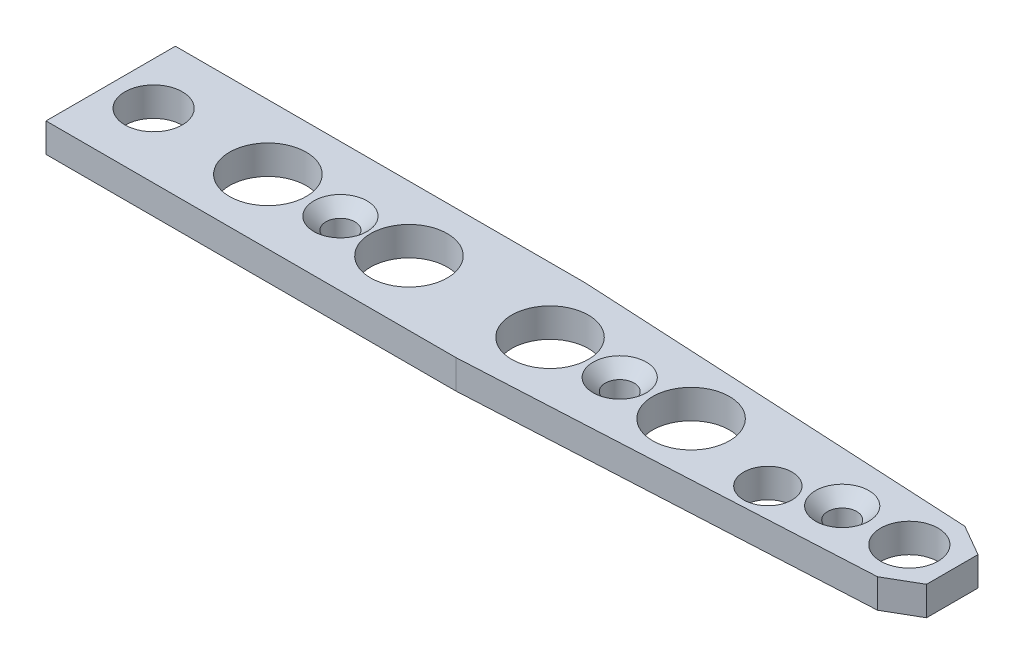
ISO-10303-21;
HEADER;
FILE_DESCRIPTION(('STEP AP214'),'2;1');
FILE_NAME('part.step','',(''),(''),'','','');
FILE_SCHEMA(('AUTOMOTIVE_DESIGN { 1 0 10303 214 1 1 1 1 }'));
ENDSEC;
DATA;
#1=APPLICATION_CONTEXT('core data for automotive mechanical design processes');
#2=APPLICATION_PROTOCOL_DEFINITION('international standard','automotive_design',2000,#1);
#3=PRODUCT_CONTEXT('',#1,'mechanical');
#4=PRODUCT('Part','Part','',(#3));
#5=PRODUCT_RELATED_PRODUCT_CATEGORY('part','',(#4));
#6=PRODUCT_DEFINITION_FORMATION('','',#4);
#7=PRODUCT_DEFINITION_CONTEXT('part definition',#1,'design');
#8=PRODUCT_DEFINITION('design','',#6,#7);
#9=PRODUCT_DEFINITION_SHAPE('','',#8);
#10=(LENGTH_UNIT() NAMED_UNIT(*) SI_UNIT(.MILLI.,.METRE.));
#11=(NAMED_UNIT(*) PLANE_ANGLE_UNIT() SI_UNIT($,.RADIAN.));
#12=(NAMED_UNIT(*) SI_UNIT($,.STERADIAN.) SOLID_ANGLE_UNIT());
#13=UNCERTAINTY_MEASURE_WITH_UNIT(LENGTH_MEASURE(1.E-05),#10,'distance_accuracy_value','');
#14=(GEOMETRIC_REPRESENTATION_CONTEXT(3) GLOBAL_UNCERTAINTY_ASSIGNED_CONTEXT((#13)) GLOBAL_UNIT_ASSIGNED_CONTEXT((#10,
#11,#12)) REPRESENTATION_CONTEXT('',''));
#15=CARTESIAN_POINT('',(0.,0.,0.));
#16=DIRECTION('',(0.,0.,1.));
#17=DIRECTION('',(1.,0.,0.));
#18=AXIS2_PLACEMENT_3D('',#15,#16,#17);
#19=CARTESIAN_POINT('',(69.6,-72.817682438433,3.47875163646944));
#20=DIRECTION('',(0.0523359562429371,0.,0.998629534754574));
#21=DIRECTION('',(0.998629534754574,0.,-0.0523359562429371));
#22=AXIS2_PLACEMENT_3D('',#19,#20,#21);
#23=PLANE('',#22);
#24=DIRECTION('',(-0.998629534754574,0.,0.0523359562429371));
#25=VECTOR('',#24,1.);
#26=CARTESIAN_POINT('',(69.6,-2.4,3.47875163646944));
#27=LINE('',#26,#25);
#28=CARTESIAN_POINT('',(67.0282897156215,-2.4,3.61352926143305));
#29=VERTEX_POINT('',#28);
#30=CARTESIAN_POINT('',(33.894454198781,-2.4,5.35));
#31=VERTEX_POINT('',#30);
#32=EDGE_CURVE('E152',#29,#31,#27,.T.);
#33=ORIENTED_EDGE('',*,*,#32,.F.);
#34=DIRECTION('',(0.,1.,0.));
#35=VECTOR('',#34,1.);
#36=CARTESIAN_POINT('',(67.0282897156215,-72.817682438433,3.61352926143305));
#37=LINE('',#36,#35);
#38=CARTESIAN_POINT('',(67.0282897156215,0.,3.61352926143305));
#39=VERTEX_POINT('',#38);
#40=EDGE_CURVE('E13',#29,#39,#37,.T.);
#41=ORIENTED_EDGE('',*,*,#40,.T.);
#42=DIRECTION('',(0.998629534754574,0.,-0.0523359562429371));
#43=VECTOR('',#42,1.);
#44=CARTESIAN_POINT('',(69.6,0.,3.47875163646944));
#45=LINE('',#44,#43);
#46=CARTESIAN_POINT('',(33.894454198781,0.,5.35));
#47=VERTEX_POINT('',#46);
#48=EDGE_CURVE('E317',#47,#39,#45,.T.);
#49=ORIENTED_EDGE('',*,*,#48,.F.);
#50=DIRECTION('',(0.,1.,0.));
#51=VECTOR('',#50,1.);
#52=CARTESIAN_POINT('',(33.894454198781,-72.817682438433,5.35));
#53=LINE('',#52,#51);
#54=EDGE_CURVE('E144',#31,#47,#53,.T.);
#55=ORIENTED_EDGE('',*,*,#54,.F.);
#56=EDGE_LOOP('',(#33,#41,#49,#55));
#57=FACE_BOUND('',#56,.T.);
#58=ADVANCED_FACE('F48',(#57),#23,.T.);
#59=CARTESIAN_POINT('',(33.894454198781,-72.817682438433,5.35));
#60=DIRECTION('',(0.,0.,1.));
#61=DIRECTION('',(1.,0.,0.));
#62=AXIS2_PLACEMENT_3D('',#59,#60,#61);
#63=PLANE('',#62);
#64=DIRECTION('',(-1.,0.,0.));
#65=VECTOR('',#64,1.);
#66=CARTESIAN_POINT('',(33.894454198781,-2.4,5.35));
#67=LINE('',#66,#65);
#68=CARTESIAN_POINT('',(0.,-2.4,5.35));
#69=VERTEX_POINT('',#68);
#70=EDGE_CURVE('E331',#31,#69,#67,.T.);
#71=ORIENTED_EDGE('',*,*,#70,.F.);
#72=ORIENTED_EDGE('',*,*,#54,.T.);
#73=DIRECTION('',(1.,0.,0.));
#74=VECTOR('',#73,1.);
#75=CARTESIAN_POINT('',(33.894454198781,0.,5.35));
#76=LINE('',#75,#74);
#77=CARTESIAN_POINT('',(0.,0.,5.35));
#78=VERTEX_POINT('',#77);
#79=EDGE_CURVE('E132',#78,#47,#76,.T.);
#80=ORIENTED_EDGE('',*,*,#79,.F.);
#81=DIRECTION('',(0.,1.,0.));
#82=VECTOR('',#81,1.);
#83=CARTESIAN_POINT('',(0.,-72.817682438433,5.35));
#84=LINE('',#83,#82);
#85=EDGE_CURVE('E146',#69,#78,#84,.T.);
#86=ORIENTED_EDGE('',*,*,#85,.F.);
#87=EDGE_LOOP('',(#71,#72,#80,#86));
#88=FACE_BOUND('',#87,.T.);
#89=ADVANCED_FACE('F183',(#88),#63,.T.);
#90=CARTESIAN_POINT('',(0.,-72.817682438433,-5.35));
#91=DIRECTION('',(-1.,0.,0.));
#92=DIRECTION('',(0.,0.,1.));
#93=AXIS2_PLACEMENT_3D('',#90,#91,#92);
#94=PLANE('',#93);
#95=DIRECTION('',(0.,0.,-1.));
#96=VECTOR('',#95,1.);
#97=CARTESIAN_POINT('',(0.,-2.4,-5.35));
#98=LINE('',#97,#96);
#99=CARTESIAN_POINT('',(0.,-2.4,-5.35));
#100=VERTEX_POINT('',#99);
#101=EDGE_CURVE('E329',#69,#100,#98,.T.);
#102=ORIENTED_EDGE('',*,*,#101,.F.);
#103=ORIENTED_EDGE('',*,*,#85,.T.);
#104=DIRECTION('',(0.,0.,1.));
#105=VECTOR('',#104,1.);
#106=CARTESIAN_POINT('',(0.,0.,-5.35));
#107=LINE('',#106,#105);
#108=CARTESIAN_POINT('',(0.,0.,-5.35));
#109=VERTEX_POINT('',#108);
#110=EDGE_CURVE('E137',#109,#78,#107,.T.);
#111=ORIENTED_EDGE('',*,*,#110,.F.);
#112=DIRECTION('',(0.,1.,0.));
#113=VECTOR('',#112,1.);
#114=CARTESIAN_POINT('',(0.,-72.817682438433,-5.35));
#115=LINE('',#114,#113);
#116=EDGE_CURVE('E131',#100,#109,#115,.T.);
#117=ORIENTED_EDGE('',*,*,#116,.F.);
#118=EDGE_LOOP('',(#102,#103,#111,#117));
#119=FACE_BOUND('',#118,.T.);
#120=ADVANCED_FACE('F188',(#119),#94,.T.);
#121=CARTESIAN_POINT('',(0.,-72.817682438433,-5.35));
#122=DIRECTION('',(0.,0.,-1.));
#123=DIRECTION('',(-1.,0.,0.));
#124=AXIS2_PLACEMENT_3D('',#121,#122,#123);
#125=PLANE('',#124);
#126=DIRECTION('',(1.,0.,0.));
#127=VECTOR('',#126,1.);
#128=CARTESIAN_POINT('',(0.,-2.4,-5.35));
#129=LINE('',#128,#127);
#130=CARTESIAN_POINT('',(33.894454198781,-2.4,-5.35));
#131=VERTEX_POINT('',#130);
#132=EDGE_CURVE('E327',#100,#131,#129,.T.);
#133=ORIENTED_EDGE('',*,*,#132,.F.);
#134=ORIENTED_EDGE('',*,*,#116,.T.);
#135=DIRECTION('',(-1.,0.,0.));
#136=VECTOR('',#135,1.);
#137=CARTESIAN_POINT('',(0.,0.,-5.35));
#138=LINE('',#137,#136);
#139=CARTESIAN_POINT('',(33.894454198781,0.,-5.35));
#140=VERTEX_POINT('',#139);
#141=EDGE_CURVE('E121',#140,#109,#138,.T.);
#142=ORIENTED_EDGE('',*,*,#141,.F.);
#143=DIRECTION('',(0.,1.,0.));
#144=VECTOR('',#143,1.);
#145=CARTESIAN_POINT('',(33.894454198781,-72.817682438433,-5.35));
#146=LINE('',#145,#144);
#147=EDGE_CURVE('E126',#131,#140,#146,.T.);
#148=ORIENTED_EDGE('',*,*,#147,.F.);
#149=EDGE_LOOP('',(#133,#134,#142,#148));
#150=FACE_BOUND('',#149,.T.);
#151=ADVANCED_FACE('F134',(#150),#125,.T.);
#152=CARTESIAN_POINT('',(33.894454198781,-72.817682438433,-5.35));
#153=DIRECTION('',(0.0523359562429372,0.,-0.998629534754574));
#154=DIRECTION('',(-0.998629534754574,0.,-0.0523359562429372));
#155=AXIS2_PLACEMENT_3D('',#152,#153,#154);
#156=PLANE('',#155);
#157=DIRECTION('',(-0.998629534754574,0.,-0.0523359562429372));
#158=VECTOR('',#157,1.);
#159=CARTESIAN_POINT('',(33.894454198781,0.,-5.35));
#160=LINE('',#159,#158);
#161=CARTESIAN_POINT('',(67.0282897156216,0.,-3.61352926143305));
#162=VERTEX_POINT('',#161);
#163=EDGE_CURVE('E115',#162,#140,#160,.T.);
#164=ORIENTED_EDGE('',*,*,#163,.F.);
#165=DIRECTION('',(0.,-1.,0.));
#166=VECTOR('',#165,1.);
#167=CARTESIAN_POINT('',(67.0282897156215,-72.817682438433,-3.61352926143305));
#168=LINE('',#167,#166);
#169=CARTESIAN_POINT('',(67.0282897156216,-2.4,-3.61352926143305));
#170=VERTEX_POINT('',#169);
#171=EDGE_CURVE('E71',#162,#170,#168,.T.);
#172=ORIENTED_EDGE('',*,*,#171,.T.);
#173=DIRECTION('',(0.998629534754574,0.,0.0523359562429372));
#174=VECTOR('',#173,1.);
#175=CARTESIAN_POINT('',(33.894454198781,-2.4,-5.35));
#176=LINE('',#175,#174);
#177=EDGE_CURVE('E128',#131,#170,#176,.T.);
#178=ORIENTED_EDGE('',*,*,#177,.F.);
#179=ORIENTED_EDGE('',*,*,#147,.T.);
#180=EDGE_LOOP('',(#164,#172,#178,#179));
#181=FACE_BOUND('',#180,.T.);
#182=ADVANCED_FACE('F127',(#181),#156,.T.);
#183=CARTESIAN_POINT('',(69.6,-72.817682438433,-3.47875163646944));
#184=DIRECTION('',(1.,0.,0.));
#185=DIRECTION('',(0.,0.,-1.));
#186=AXIS2_PLACEMENT_3D('',#183,#184,#185);
#187=PLANE('',#186);
#188=DIRECTION('',(0.,0.,1.));
#189=VECTOR('',#188,1.);
#190=CARTESIAN_POINT('',(69.6,-2.4,-3.47875163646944));
#191=LINE('',#190,#189);
#192=CARTESIAN_POINT('',(69.6,-2.4,-2.12875163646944));
#193=VERTEX_POINT('',#192);
#194=CARTESIAN_POINT('',(69.6,-2.4,2.12875163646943));
#195=VERTEX_POINT('',#194);
#196=EDGE_CURVE('E149',#193,#195,#191,.T.);
#197=ORIENTED_EDGE('',*,*,#196,.F.);
#198=DIRECTION('',(0.,1.,0.));
#199=VECTOR('',#198,1.);
#200=CARTESIAN_POINT('',(69.6,-72.817682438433,-2.12875163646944));
#201=LINE('',#200,#199);
#202=CARTESIAN_POINT('',(69.6,0.,-2.12875163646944));
#203=VERTEX_POINT('',#202);
#204=EDGE_CURVE('E154',#193,#203,#201,.T.);
#205=ORIENTED_EDGE('',*,*,#204,.T.);
#206=DIRECTION('',(0.,0.,-1.));
#207=VECTOR('',#206,1.);
#208=CARTESIAN_POINT('',(69.6,0.,-3.47875163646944));
#209=LINE('',#208,#207);
#210=CARTESIAN_POINT('',(69.6,0.,2.12875163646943));
#211=VERTEX_POINT('',#210);
#212=EDGE_CURVE('E123',#211,#203,#209,.T.);
#213=ORIENTED_EDGE('',*,*,#212,.F.);
#214=DIRECTION('',(0.,-1.,0.));
#215=VECTOR('',#214,1.);
#216=CARTESIAN_POINT('',(69.6,-72.817682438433,2.12875163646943));
#217=LINE('',#216,#215);
#218=EDGE_CURVE('E151',#211,#195,#217,.T.);
#219=ORIENTED_EDGE('',*,*,#218,.T.);
#220=EDGE_LOOP('',(#197,#205,#213,#219));
#221=FACE_BOUND('',#220,.T.);
#222=ADVANCED_FACE('F167',(#221),#187,.T.);
#223=CARTESIAN_POINT('',(0.,0.,0.));
#224=DIRECTION('',(0.,1.,0.));
#225=DIRECTION('',(0.,0.,1.));
#226=AXIS2_PLACEMENT_3D('',#223,#224,#225);
#227=PLANE('',#226);
#228=CARTESIAN_POINT('',(56.,0.,1.65));
#229=DIRECTION('',(0.,1.,0.));
#230=DIRECTION('',(0.,0.,1.));
#231=AXIS2_PLACEMENT_3D('',#228,#229,#230);
#232=CIRCLE('',#231,2.);
#233=CARTESIAN_POINT('',(56.,0.,3.65));
#234=VERTEX_POINT('',#233);
#235=EDGE_CURVE('E376',#234,#234,#232,.T.);
#236=ORIENTED_EDGE('',*,*,#235,.F.);
#237=EDGE_LOOP('',(#236));
#238=FACE_BOUND('',#237,.T.);
#239=CARTESIAN_POINT('',(13.,0.,0.));
#240=DIRECTION('',(0.,1.,0.));
#241=DIRECTION('',(0.,0.,1.));
#242=AXIS2_PLACEMENT_3D('',#239,#240,#241);
#243=CIRCLE('',#242,3.175);
#244=CARTESIAN_POINT('',(13.,0.,3.175));
#245=VERTEX_POINT('',#244);
#246=EDGE_CURVE('E261',#245,#245,#243,.T.);
#247=ORIENTED_EDGE('',*,*,#246,.F.);
#248=EDGE_LOOP('',(#247));
#249=FACE_BOUND('',#248,.T.);
#250=CARTESIAN_POINT('',(24.6666666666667,0.,0.));
#251=DIRECTION('',(0.,1.,0.));
#252=DIRECTION('',(0.,0.,1.));
#253=AXIS2_PLACEMENT_3D('',#250,#251,#252);
#254=CIRCLE('',#253,3.175);
#255=CARTESIAN_POINT('',(24.6666666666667,0.,3.175));
#256=VERTEX_POINT('',#255);
#257=EDGE_CURVE('E268',#256,#256,#254,.T.);
#258=ORIENTED_EDGE('',*,*,#257,.F.);
#259=EDGE_LOOP('',(#258));
#260=FACE_BOUND('',#259,.T.);
#261=CARTESIAN_POINT('',(36.3333333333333,0.,0.));
#262=DIRECTION('',(0.,1.,0.));
#263=DIRECTION('',(0.,0.,1.));
#264=AXIS2_PLACEMENT_3D('',#261,#262,#263);
#265=CIRCLE('',#264,3.175);
#266=CARTESIAN_POINT('',(36.3333333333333,0.,3.175));
#267=VERTEX_POINT('',#266);
#268=EDGE_CURVE('E277',#267,#267,#265,.T.);
#269=ORIENTED_EDGE('',*,*,#268,.F.);
#270=EDGE_LOOP('',(#269));
#271=FACE_BOUND('',#270,.T.);
#272=CARTESIAN_POINT('',(48.,0.,0.));
#273=DIRECTION('',(0.,1.,0.));
#274=DIRECTION('',(0.,0.,1.));
#275=AXIS2_PLACEMENT_3D('',#272,#273,#274);
#276=CIRCLE('',#275,3.175);
#277=CARTESIAN_POINT('',(48.,0.,3.175));
#278=VERTEX_POINT('',#277);
#279=EDGE_CURVE('E283',#278,#278,#276,.T.);
#280=ORIENTED_EDGE('',*,*,#279,.F.);
#281=EDGE_LOOP('',(#280));
#282=FACE_BOUND('',#281,.T.);
#283=CARTESIAN_POINT('',(19.,0.,0.));
#284=DIRECTION('',(0.,1.,0.));
#285=DIRECTION('',(0.,0.,1.));
#286=AXIS2_PLACEMENT_3D('',#283,#284,#285);
#287=CIRCLE('',#286,2.2);
#288=CARTESIAN_POINT('',(19.,0.,2.2));
#289=VERTEX_POINT('',#288);
#290=EDGE_CURVE('E265',#289,#289,#287,.T.);
#291=ORIENTED_EDGE('',*,*,#290,.F.);
#292=EDGE_LOOP('',(#291));
#293=FACE_BOUND('',#292,.T.);
#294=CARTESIAN_POINT('',(42.1,0.,0.));
#295=DIRECTION('',(0.,1.,0.));
#296=DIRECTION('',(0.,0.,1.));
#297=AXIS2_PLACEMENT_3D('',#294,#295,#296);
#298=CIRCLE('',#297,2.2);
#299=CARTESIAN_POINT('',(42.1,0.,2.2));
#300=VERTEX_POINT('',#299);
#301=EDGE_CURVE('E295',#300,#300,#298,.T.);
#302=ORIENTED_EDGE('',*,*,#301,.F.);
#303=EDGE_LOOP('',(#302));
#304=FACE_BOUND('',#303,.T.);
#305=CARTESIAN_POINT('',(60.5,0.,0.));
#306=DIRECTION('',(0.,1.,0.));
#307=DIRECTION('',(0.,0.,1.));
#308=AXIS2_PLACEMENT_3D('',#305,#306,#307);
#309=CIRCLE('',#308,2.2);
#310=CARTESIAN_POINT('',(60.5,0.,2.2));
#311=VERTEX_POINT('',#310);
#312=EDGE_CURVE('E304',#311,#311,#309,.T.);
#313=ORIENTED_EDGE('',*,*,#312,.F.);
#314=EDGE_LOOP('',(#313));
#315=FACE_BOUND('',#314,.T.);
#316=CARTESIAN_POINT('',(3.55,0.,0.));
#317=DIRECTION('',(0.,1.,0.));
#318=DIRECTION('',(0.,0.,1.));
#319=AXIS2_PLACEMENT_3D('',#316,#317,#318);
#320=CIRCLE('',#319,2.375);
#321=CARTESIAN_POINT('',(3.55,0.,2.375));
#322=VERTEX_POINT('',#321);
#323=EDGE_CURVE('E318',#322,#322,#320,.T.);
#324=ORIENTED_EDGE('',*,*,#323,.F.);
#325=EDGE_LOOP('',(#324));
#326=FACE_BOUND('',#325,.T.);
#327=CARTESIAN_POINT('',(66.05,0.,0.));
#328=DIRECTION('',(0.,1.,0.));
#329=DIRECTION('',(0.,0.,1.));
#330=AXIS2_PLACEMENT_3D('',#327,#328,#329);
#331=CIRCLE('',#330,2.375);
#332=CARTESIAN_POINT('',(66.05,0.,2.375));
#333=VERTEX_POINT('',#332);
#334=EDGE_CURVE('E313',#333,#333,#331,.T.);
#335=ORIENTED_EDGE('',*,*,#334,.F.);
#336=EDGE_LOOP('',(#335));
#337=FACE_BOUND('',#336,.T.);
#338=ORIENTED_EDGE('',*,*,#212,.T.);
#339=DIRECTION('',(0.866025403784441,0.,0.499999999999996));
#340=VECTOR('',#339,1.);
#341=CARTESIAN_POINT('',(18.3217764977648,0.,-31.7342477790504));
#342=LINE('',#341,#340);
#343=EDGE_CURVE('E122',#203,#162,#342,.F.);
#344=ORIENTED_EDGE('',*,*,#343,.T.);
#345=ORIENTED_EDGE('',*,*,#163,.T.);
#346=ORIENTED_EDGE('',*,*,#141,.T.);
#347=ORIENTED_EDGE('',*,*,#110,.T.);
#348=ORIENTED_EDGE('',*,*,#79,.T.);
#349=ORIENTED_EDGE('',*,*,#48,.T.);
#350=DIRECTION('',(-0.86602540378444,0.,0.499999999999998));
#351=VECTOR('',#350,1.);
#352=CARTESIAN_POINT('',(18.3217764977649,0.,31.7342477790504));
#353=LINE('',#352,#351);
#354=EDGE_CURVE('E157',#39,#211,#353,.F.);
#355=ORIENTED_EDGE('',*,*,#354,.T.);
#356=EDGE_LOOP('',(#338,#344,#345,#346,#347,#348,#349,#355));
#357=FACE_BOUND('',#356,.T.);
#358=ADVANCED_FACE('F118',(#238,#249,#260,#271,#282,#293,#304,#315,#326,#337,#357),#227,.T.);
#359=CARTESIAN_POINT('',(0.,-2.4,0.));
#360=DIRECTION('',(0.,1.,0.));
#361=DIRECTION('',(0.,0.,1.));
#362=AXIS2_PLACEMENT_3D('',#359,#360,#361);
#363=PLANE('',#362);
#364=CARTESIAN_POINT('',(56.,-2.4,1.65));
#365=DIRECTION('',(0.,1.,0.));
#366=DIRECTION('',(0.,0.,1.));
#367=AXIS2_PLACEMENT_3D('',#364,#365,#366);
#368=CIRCLE('',#367,2.);
#369=CARTESIAN_POINT('',(56.,-2.4,3.65));
#370=VERTEX_POINT('',#369);
#371=EDGE_CURVE('E286',#370,#370,#368,.T.);
#372=ORIENTED_EDGE('',*,*,#371,.T.);
#373=EDGE_LOOP('',(#372));
#374=FACE_BOUND('',#373,.T.);
#375=CARTESIAN_POINT('',(13.,-2.4,0.));
#376=DIRECTION('',(0.,1.,0.));
#377=DIRECTION('',(0.,0.,1.));
#378=AXIS2_PLACEMENT_3D('',#375,#376,#377);
#379=CIRCLE('',#378,3.175);
#380=CARTESIAN_POINT('',(13.,-2.4,3.175));
#381=VERTEX_POINT('',#380);
#382=EDGE_CURVE('E258',#381,#381,#379,.T.);
#383=ORIENTED_EDGE('',*,*,#382,.T.);
#384=EDGE_LOOP('',(#383));
#385=FACE_BOUND('',#384,.T.);
#386=CARTESIAN_POINT('',(24.6666666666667,-2.4,0.));
#387=DIRECTION('',(0.,1.,0.));
#388=DIRECTION('',(0.,0.,1.));
#389=AXIS2_PLACEMENT_3D('',#386,#387,#388);
#390=CIRCLE('',#389,3.175);
#391=CARTESIAN_POINT('',(24.6666666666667,-2.4,3.175));
#392=VERTEX_POINT('',#391);
#393=EDGE_CURVE('E263',#392,#392,#390,.T.);
#394=ORIENTED_EDGE('',*,*,#393,.T.);
#395=EDGE_LOOP('',(#394));
#396=FACE_BOUND('',#395,.T.);
#397=CARTESIAN_POINT('',(36.3333333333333,-2.4,0.));
#398=DIRECTION('',(0.,1.,0.));
#399=DIRECTION('',(0.,0.,1.));
#400=AXIS2_PLACEMENT_3D('',#397,#398,#399);
#401=CIRCLE('',#400,3.175);
#402=CARTESIAN_POINT('',(36.3333333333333,-2.4,3.175));
#403=VERTEX_POINT('',#402);
#404=EDGE_CURVE('E274',#403,#403,#401,.T.);
#405=ORIENTED_EDGE('',*,*,#404,.T.);
#406=EDGE_LOOP('',(#405));
#407=FACE_BOUND('',#406,.T.);
#408=CARTESIAN_POINT('',(48.,-2.4,0.));
#409=DIRECTION('',(0.,1.,0.));
#410=DIRECTION('',(0.,0.,1.));
#411=AXIS2_PLACEMENT_3D('',#408,#409,#410);
#412=CIRCLE('',#411,3.175);
#413=CARTESIAN_POINT('',(48.,-2.4,3.175));
#414=VERTEX_POINT('',#413);
#415=EDGE_CURVE('E280',#414,#414,#412,.T.);
#416=ORIENTED_EDGE('',*,*,#415,.T.);
#417=EDGE_LOOP('',(#416));
#418=FACE_BOUND('',#417,.T.);
#419=CARTESIAN_POINT('',(19.,-2.4,0.));
#420=DIRECTION('',(0.,1.,0.));
#421=DIRECTION('',(0.,0.,1.));
#422=AXIS2_PLACEMENT_3D('',#419,#420,#421);
#423=CIRCLE('',#422,1.2);
#424=CARTESIAN_POINT('',(19.,-2.4,1.2));
#425=VERTEX_POINT('',#424);
#426=EDGE_CURVE('E292',#425,#425,#423,.T.);
#427=ORIENTED_EDGE('',*,*,#426,.T.);
#428=EDGE_LOOP('',(#427));
#429=FACE_BOUND('',#428,.T.);
#430=CARTESIAN_POINT('',(42.1,-2.4,0.));
#431=DIRECTION('',(0.,1.,0.));
#432=DIRECTION('',(0.,0.,1.));
#433=AXIS2_PLACEMENT_3D('',#430,#431,#432);
#434=CIRCLE('',#433,1.2);
#435=CARTESIAN_POINT('',(42.1,-2.4,1.2));
#436=VERTEX_POINT('',#435);
#437=EDGE_CURVE('E301',#436,#436,#434,.T.);
#438=ORIENTED_EDGE('',*,*,#437,.T.);
#439=EDGE_LOOP('',(#438));
#440=FACE_BOUND('',#439,.T.);
#441=CARTESIAN_POINT('',(60.5,-2.4,0.));
#442=DIRECTION('',(0.,1.,0.));
#443=DIRECTION('',(0.,0.,1.));
#444=AXIS2_PLACEMENT_3D('',#441,#442,#443);
#445=CIRCLE('',#444,1.2);
#446=CARTESIAN_POINT('',(60.5,-2.4,1.2));
#447=VERTEX_POINT('',#446);
#448=EDGE_CURVE('E310',#447,#447,#445,.T.);
#449=ORIENTED_EDGE('',*,*,#448,.T.);
#450=EDGE_LOOP('',(#449));
#451=FACE_BOUND('',#450,.T.);
#452=CARTESIAN_POINT('',(3.55,-2.4,0.));
#453=DIRECTION('',(0.,1.,0.));
#454=DIRECTION('',(0.,0.,1.));
#455=AXIS2_PLACEMENT_3D('',#452,#453,#454);
#456=CIRCLE('',#455,2.375);
#457=CARTESIAN_POINT('',(3.55,-2.4,2.375));
#458=VERTEX_POINT('',#457);
#459=EDGE_CURVE('E314',#458,#458,#456,.T.);
#460=ORIENTED_EDGE('',*,*,#459,.T.);
#461=EDGE_LOOP('',(#460));
#462=FACE_BOUND('',#461,.T.);
#463=CARTESIAN_POINT('',(66.05,-2.4,0.));
#464=DIRECTION('',(0.,1.,0.));
#465=DIRECTION('',(0.,0.,1.));
#466=AXIS2_PLACEMENT_3D('',#463,#464,#465);
#467=CIRCLE('',#466,2.375);
#468=CARTESIAN_POINT('',(66.05,-2.4,2.375));
#469=VERTEX_POINT('',#468);
#470=EDGE_CURVE('E321',#469,#469,#467,.T.);
#471=ORIENTED_EDGE('',*,*,#470,.T.);
#472=EDGE_LOOP('',(#471));
#473=FACE_BOUND('',#472,.T.);
#474=ORIENTED_EDGE('',*,*,#177,.T.);
#475=DIRECTION('',(-0.866025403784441,0.,-0.499999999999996));
#476=VECTOR('',#475,1.);
#477=CARTESIAN_POINT('',(69.6,-2.4,-2.12875163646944));
#478=LINE('',#477,#476);
#479=EDGE_CURVE('E56',#170,#193,#478,.F.);
#480=ORIENTED_EDGE('',*,*,#479,.T.);
#481=ORIENTED_EDGE('',*,*,#196,.T.);
#482=DIRECTION('',(0.86602540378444,0.,-0.499999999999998));
#483=VECTOR('',#482,1.);
#484=CARTESIAN_POINT('',(67.0282897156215,-2.4,3.61352926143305));
#485=LINE('',#484,#483);
#486=EDGE_CURVE('E63',#195,#29,#485,.F.);
#487=ORIENTED_EDGE('',*,*,#486,.T.);
#488=ORIENTED_EDGE('',*,*,#32,.T.);
#489=ORIENTED_EDGE('',*,*,#70,.T.);
#490=ORIENTED_EDGE('',*,*,#101,.T.);
#491=ORIENTED_EDGE('',*,*,#132,.T.);
#492=EDGE_LOOP('',(#474,#480,#481,#487,#488,#489,#490,#491));
#493=FACE_BOUND('',#492,.T.);
#494=ADVANCED_FACE('F163',(#374,#385,#396,#407,#418,#429,#440,#451,#462,#473,#493),#363,.F.);
#495=CARTESIAN_POINT('',(66.05,-2.4,0.));
#496=DIRECTION('',(0.,1.,0.));
#497=DIRECTION('',(0.,0.,1.));
#498=AXIS2_PLACEMENT_3D('',#495,#496,#497);
#499=CYLINDRICAL_SURFACE('',#498,2.375);
#500=ORIENTED_EDGE('',*,*,#470,.F.);
#501=EDGE_LOOP('',(#500));
#502=FACE_BOUND('',#501,.T.);
#503=ORIENTED_EDGE('',*,*,#334,.T.);
#504=EDGE_LOOP('',(#503));
#505=FACE_BOUND('',#504,.T.);
#506=ADVANCED_FACE('F206',(#502,#505),#499,.F.);
#507=CARTESIAN_POINT('',(3.55,-2.4,0.));
#508=DIRECTION('',(0.,1.,0.));
#509=DIRECTION('',(0.,0.,1.));
#510=AXIS2_PLACEMENT_3D('',#507,#508,#509);
#511=CYLINDRICAL_SURFACE('',#510,2.375);
#512=ORIENTED_EDGE('',*,*,#459,.F.);
#513=EDGE_LOOP('',(#512));
#514=FACE_BOUND('',#513,.T.);
#515=ORIENTED_EDGE('',*,*,#323,.T.);
#516=EDGE_LOOP('',(#515));
#517=FACE_BOUND('',#516,.T.);
#518=ADVANCED_FACE('F210',(#514,#517),#511,.F.);
#519=CARTESIAN_POINT('',(60.5,0.,0.));
#520=DIRECTION('',(0.,1.,0.));
#521=DIRECTION('',(0.,0.,1.));
#522=AXIS2_PLACEMENT_3D('',#519,#520,#521);
#523=CYLINDRICAL_SURFACE('',#522,1.2);
#524=ORIENTED_EDGE('',*,*,#448,.F.);
#525=EDGE_LOOP('',(#524));
#526=FACE_BOUND('',#525,.T.);
#527=CARTESIAN_POINT('',(60.5,-1.,0.));
#528=DIRECTION('',(0.,1.,0.));
#529=DIRECTION('',(0.,0.,1.));
#530=AXIS2_PLACEMENT_3D('',#527,#528,#529);
#531=CIRCLE('',#530,1.2);
#532=CARTESIAN_POINT('',(60.5,-1.,1.2));
#533=VERTEX_POINT('',#532);
#534=EDGE_CURVE('E307',#533,#533,#531,.T.);
#535=ORIENTED_EDGE('',*,*,#534,.T.);
#536=EDGE_LOOP('',(#535));
#537=FACE_BOUND('',#536,.T.);
#538=ADVANCED_FACE('F214',(#526,#537),#523,.F.);
#539=CARTESIAN_POINT('',(60.5,0.,0.));
#540=DIRECTION('',(0.,1.,0.));
#541=DIRECTION('',(0.,0.,1.));
#542=AXIS2_PLACEMENT_3D('',#539,#540,#541);
#543=CONICAL_SURFACE('',#542,2.2,0.785398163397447);
#544=ORIENTED_EDGE('',*,*,#534,.F.);
#545=EDGE_LOOP('',(#544));
#546=FACE_BOUND('',#545,.T.);
#547=ORIENTED_EDGE('',*,*,#312,.T.);
#548=EDGE_LOOP('',(#547));
#549=FACE_BOUND('',#548,.T.);
#550=ADVANCED_FACE('F218',(#546,#549),#543,.F.);
#551=CARTESIAN_POINT('',(42.1,0.,0.));
#552=DIRECTION('',(0.,1.,0.));
#553=DIRECTION('',(0.,0.,1.));
#554=AXIS2_PLACEMENT_3D('',#551,#552,#553);
#555=CYLINDRICAL_SURFACE('',#554,1.2);
#556=ORIENTED_EDGE('',*,*,#437,.F.);
#557=EDGE_LOOP('',(#556));
#558=FACE_BOUND('',#557,.T.);
#559=CARTESIAN_POINT('',(42.1,-1.,0.));
#560=DIRECTION('',(0.,1.,0.));
#561=DIRECTION('',(0.,0.,1.));
#562=AXIS2_PLACEMENT_3D('',#559,#560,#561);
#563=CIRCLE('',#562,1.2);
#564=CARTESIAN_POINT('',(42.1,-1.,1.2));
#565=VERTEX_POINT('',#564);
#566=EDGE_CURVE('E298',#565,#565,#563,.T.);
#567=ORIENTED_EDGE('',*,*,#566,.T.);
#568=EDGE_LOOP('',(#567));
#569=FACE_BOUND('',#568,.T.);
#570=ADVANCED_FACE('F222',(#558,#569),#555,.F.);
#571=CARTESIAN_POINT('',(42.1,0.,0.));
#572=DIRECTION('',(0.,1.,0.));
#573=DIRECTION('',(0.,0.,1.));
#574=AXIS2_PLACEMENT_3D('',#571,#572,#573);
#575=CONICAL_SURFACE('',#574,2.2,0.785398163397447);
#576=ORIENTED_EDGE('',*,*,#566,.F.);
#577=EDGE_LOOP('',(#576));
#578=FACE_BOUND('',#577,.T.);
#579=ORIENTED_EDGE('',*,*,#301,.T.);
#580=EDGE_LOOP('',(#579));
#581=FACE_BOUND('',#580,.T.);
#582=ADVANCED_FACE('F226',(#578,#581),#575,.F.);
#583=CARTESIAN_POINT('',(19.,0.,0.));
#584=DIRECTION('',(0.,1.,0.));
#585=DIRECTION('',(0.,0.,1.));
#586=AXIS2_PLACEMENT_3D('',#583,#584,#585);
#587=CYLINDRICAL_SURFACE('',#586,1.2);
#588=ORIENTED_EDGE('',*,*,#426,.F.);
#589=EDGE_LOOP('',(#588));
#590=FACE_BOUND('',#589,.T.);
#591=CARTESIAN_POINT('',(19.,-1.,0.));
#592=DIRECTION('',(0.,1.,0.));
#593=DIRECTION('',(0.,0.,1.));
#594=AXIS2_PLACEMENT_3D('',#591,#592,#593);
#595=CIRCLE('',#594,1.2);
#596=CARTESIAN_POINT('',(19.,-1.,1.2));
#597=VERTEX_POINT('',#596);
#598=EDGE_CURVE('E289',#597,#597,#595,.T.);
#599=ORIENTED_EDGE('',*,*,#598,.T.);
#600=EDGE_LOOP('',(#599));
#601=FACE_BOUND('',#600,.T.);
#602=ADVANCED_FACE('F230',(#590,#601),#587,.F.);
#603=CARTESIAN_POINT('',(19.,0.,0.));
#604=DIRECTION('',(0.,1.,0.));
#605=DIRECTION('',(0.,0.,1.));
#606=AXIS2_PLACEMENT_3D('',#603,#604,#605);
#607=CONICAL_SURFACE('',#606,2.2,0.785398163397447);
#608=ORIENTED_EDGE('',*,*,#598,.F.);
#609=EDGE_LOOP('',(#608));
#610=FACE_BOUND('',#609,.T.);
#611=ORIENTED_EDGE('',*,*,#290,.T.);
#612=EDGE_LOOP('',(#611));
#613=FACE_BOUND('',#612,.T.);
#614=ADVANCED_FACE('F234',(#610,#613),#607,.F.);
#615=CARTESIAN_POINT('',(48.,-2.4,0.));
#616=DIRECTION('',(0.,1.,0.));
#617=DIRECTION('',(0.,0.,1.));
#618=AXIS2_PLACEMENT_3D('',#615,#616,#617);
#619=CYLINDRICAL_SURFACE('',#618,3.175);
#620=ORIENTED_EDGE('',*,*,#415,.F.);
#621=EDGE_LOOP('',(#620));
#622=FACE_BOUND('',#621,.T.);
#623=ORIENTED_EDGE('',*,*,#279,.T.);
#624=EDGE_LOOP('',(#623));
#625=FACE_BOUND('',#624,.T.);
#626=ADVANCED_FACE('F238',(#622,#625),#619,.F.);
#627=CARTESIAN_POINT('',(36.3333333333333,-2.4,0.));
#628=DIRECTION('',(0.,1.,0.));
#629=DIRECTION('',(0.,0.,1.));
#630=AXIS2_PLACEMENT_3D('',#627,#628,#629);
#631=CYLINDRICAL_SURFACE('',#630,3.175);
#632=ORIENTED_EDGE('',*,*,#404,.F.);
#633=EDGE_LOOP('',(#632));
#634=FACE_BOUND('',#633,.T.);
#635=ORIENTED_EDGE('',*,*,#268,.T.);
#636=EDGE_LOOP('',(#635));
#637=FACE_BOUND('',#636,.T.);
#638=ADVANCED_FACE('F242',(#634,#637),#631,.F.);
#639=CARTESIAN_POINT('',(24.6666666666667,-2.4,0.));
#640=DIRECTION('',(0.,1.,0.));
#641=DIRECTION('',(0.,0.,1.));
#642=AXIS2_PLACEMENT_3D('',#639,#640,#641);
#643=CYLINDRICAL_SURFACE('',#642,3.175);
#644=ORIENTED_EDGE('',*,*,#393,.F.);
#645=EDGE_LOOP('',(#644));
#646=FACE_BOUND('',#645,.T.);
#647=ORIENTED_EDGE('',*,*,#257,.T.);
#648=EDGE_LOOP('',(#647));
#649=FACE_BOUND('',#648,.T.);
#650=ADVANCED_FACE('F246',(#646,#649),#643,.F.);
#651=CARTESIAN_POINT('',(13.,-2.4,0.));
#652=DIRECTION('',(0.,1.,0.));
#653=DIRECTION('',(0.,0.,1.));
#654=AXIS2_PLACEMENT_3D('',#651,#652,#653);
#655=CYLINDRICAL_SURFACE('',#654,3.175);
#656=ORIENTED_EDGE('',*,*,#382,.F.);
#657=EDGE_LOOP('',(#656));
#658=FACE_BOUND('',#657,.T.);
#659=ORIENTED_EDGE('',*,*,#246,.T.);
#660=EDGE_LOOP('',(#659));
#661=FACE_BOUND('',#660,.T.);
#662=ADVANCED_FACE('F178',(#658,#661),#655,.F.);
#663=CARTESIAN_POINT('',(56.,-2.4,1.65));
#664=DIRECTION('',(0.,1.,0.));
#665=DIRECTION('',(0.,0.,1.));
#666=AXIS2_PLACEMENT_3D('',#663,#664,#665);
#667=CYLINDRICAL_SURFACE('',#666,2.);
#668=ORIENTED_EDGE('',*,*,#371,.F.);
#669=EDGE_LOOP('',(#668));
#670=FACE_BOUND('',#669,.T.);
#671=ORIENTED_EDGE('',*,*,#235,.T.);
#672=EDGE_LOOP('',(#671));
#673=FACE_BOUND('',#672,.T.);
#674=ADVANCED_FACE('F172',(#670,#673),#667,.F.);
#675=CARTESIAN_POINT('',(69.6,-72.817682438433,-2.12875163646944));
#676=DIRECTION('',(-0.499999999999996,0.,0.866025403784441));
#677=DIRECTION('',(0.,1.,0.));
#678=AXIS2_PLACEMENT_3D('',#675,#676,#677);
#679=PLANE('',#678);
#680=ORIENTED_EDGE('',*,*,#479,.F.);
#681=ORIENTED_EDGE('',*,*,#171,.F.);
#682=ORIENTED_EDGE('',*,*,#343,.F.);
#683=ORIENTED_EDGE('',*,*,#204,.F.);
#684=EDGE_LOOP('',(#680,#681,#682,#683));
#685=FACE_BOUND('',#684,.T.);
#686=ADVANCED_FACE('F170',(#685),#679,.F.);
#687=CARTESIAN_POINT('',(67.0282897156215,-72.817682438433,3.61352926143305));
#688=DIRECTION('',(-0.499999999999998,0.,-0.86602540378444));
#689=DIRECTION('',(0.,1.,0.));
#690=AXIS2_PLACEMENT_3D('',#687,#688,#689);
#691=PLANE('',#690);
#692=ORIENTED_EDGE('',*,*,#486,.F.);
#693=ORIENTED_EDGE('',*,*,#218,.F.);
#694=ORIENTED_EDGE('',*,*,#354,.F.);
#695=ORIENTED_EDGE('',*,*,#40,.F.);
#696=EDGE_LOOP('',(#692,#693,#694,#695));
#697=FACE_BOUND('',#696,.T.);
#698=ADVANCED_FACE('F50',(#697),#691,.F.);
#699=CLOSED_SHELL('',(#58,#89,#120,#151,#182,#222,#358,#494,#506,#518,#538,#550,#570,#582,#602,
#614,#626,#638,#650,#662,#674,#686,#698));
#700=MANIFOLD_SOLID_BREP('B2',#699);
#701=ADVANCED_BREP_SHAPE_REPRESENTATION('',(#18,#700),#14);
#702=SHAPE_DEFINITION_REPRESENTATION(#9,#701);
ENDSEC;
END-ISO-10303-21;
